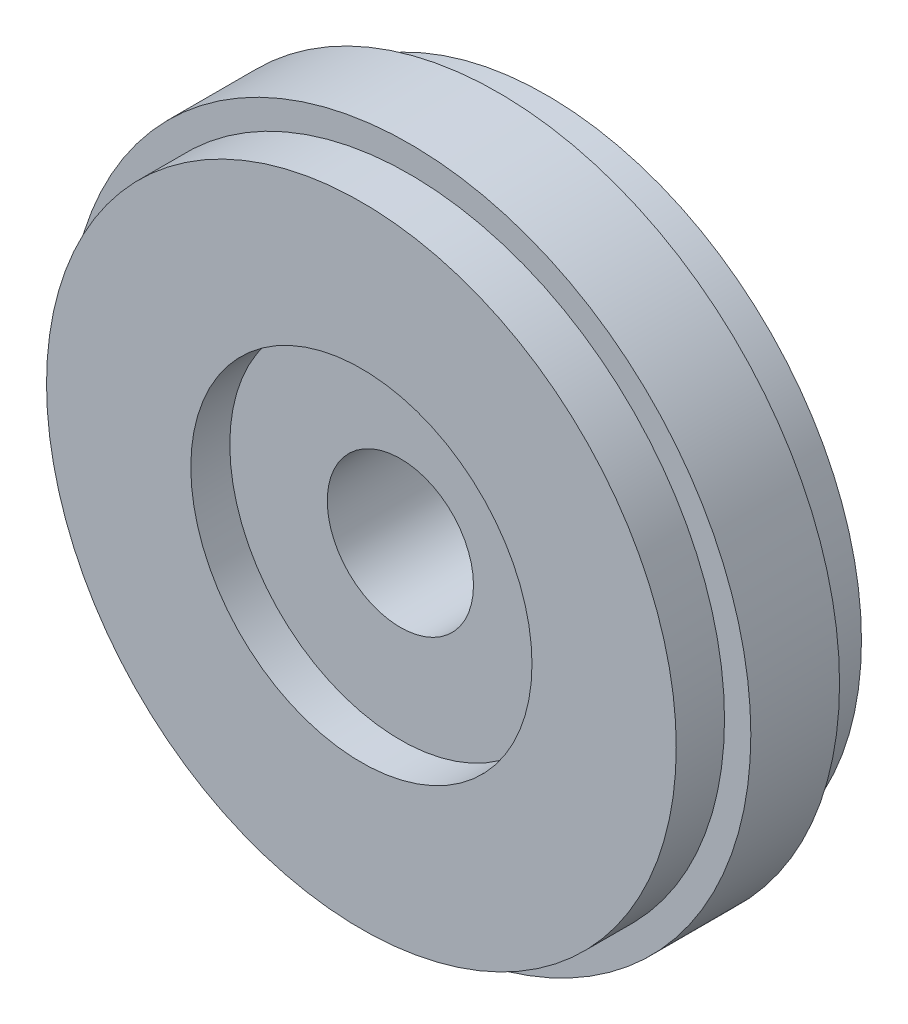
ISO-10303-21;
HEADER;
FILE_DESCRIPTION(('STEP AP214'),'2;1');
FILE_NAME('part.step','',(''),(''),'','','');
FILE_SCHEMA(('AUTOMOTIVE_DESIGN { 1 0 10303 214 1 1 1 1 }'));
ENDSEC;
DATA;
#1=APPLICATION_CONTEXT('core data for automotive mechanical design processes');
#2=APPLICATION_PROTOCOL_DEFINITION('international standard','automotive_design',2000,#1);
#3=PRODUCT_CONTEXT('',#1,'mechanical');
#4=PRODUCT('Part','Part','',(#3));
#5=PRODUCT_RELATED_PRODUCT_CATEGORY('part','',(#4));
#6=PRODUCT_DEFINITION_FORMATION('','',#4);
#7=PRODUCT_DEFINITION_CONTEXT('part definition',#1,'design');
#8=PRODUCT_DEFINITION('design','',#6,#7);
#9=PRODUCT_DEFINITION_SHAPE('','',#8);
#10=(LENGTH_UNIT() NAMED_UNIT(*) SI_UNIT(.MILLI.,.METRE.));
#11=(NAMED_UNIT(*) PLANE_ANGLE_UNIT() SI_UNIT($,.RADIAN.));
#12=(NAMED_UNIT(*) SI_UNIT($,.STERADIAN.) SOLID_ANGLE_UNIT());
#13=UNCERTAINTY_MEASURE_WITH_UNIT(LENGTH_MEASURE(1.E-05),#10,'distance_accuracy_value','');
#14=(GEOMETRIC_REPRESENTATION_CONTEXT(3) GLOBAL_UNCERTAINTY_ASSIGNED_CONTEXT((#13)) GLOBAL_UNIT_ASSIGNED_CONTEXT((#10,
#11,#12)) REPRESENTATION_CONTEXT('',''));
#15=CARTESIAN_POINT('',(0.,0.,0.));
#16=DIRECTION('',(0.,0.,1.));
#17=DIRECTION('',(1.,0.,0.));
#18=AXIS2_PLACEMENT_3D('',#15,#16,#17);
#19=CARTESIAN_POINT('',(0.,35.,9.5));
#20=DIRECTION('',(0.,0.,-1.));
#21=DIRECTION('',(-1.,0.,0.));
#22=AXIS2_PLACEMENT_3D('',#19,#20,#21);
#23=PLANE('',#22);
#24=CARTESIAN_POINT('',(0.,0.,9.5));
#25=DIRECTION('',(0.,0.,1.));
#26=DIRECTION('',(1.,0.,0.));
#27=AXIS2_PLACEMENT_3D('',#24,#25,#26);
#28=CIRCLE('',#27,17.5);
#29=CARTESIAN_POINT('',(17.5,0.,9.5));
#30=VERTEX_POINT('',#29);
#31=EDGE_CURVE('E8',#30,#30,#28,.T.);
#32=ORIENTED_EDGE('',*,*,#31,.F.);
#33=EDGE_LOOP('',(#32));
#34=FACE_BOUND('',#33,.T.);
#35=CARTESIAN_POINT('',(0.,0.,9.5));
#36=DIRECTION('',(0.,0.,-1.));
#37=DIRECTION('',(-1.,0.,0.));
#38=AXIS2_PLACEMENT_3D('',#35,#36,#37);
#39=CIRCLE('',#38,32.3);
#40=CARTESIAN_POINT('',(-32.3,0.,9.5));
#41=VERTEX_POINT('',#40);
#42=EDGE_CURVE('E15',#41,#41,#39,.T.);
#43=ORIENTED_EDGE('',*,*,#42,.F.);
#44=EDGE_LOOP('',(#43));
#45=FACE_BOUND('',#44,.T.);
#46=ADVANCED_FACE('F12',(#34,#45),#23,.F.);
#47=CARTESIAN_POINT('',(0.,14.5,-9.5));
#48=DIRECTION('',(0.,0.,1.));
#49=DIRECTION('',(1.,0.,0.));
#50=AXIS2_PLACEMENT_3D('',#47,#48,#49);
#51=PLANE('',#50);
#52=CARTESIAN_POINT('',(0.,0.,-9.5));
#53=DIRECTION('',(0.,0.,1.));
#54=DIRECTION('',(1.,0.,0.));
#55=AXIS2_PLACEMENT_3D('',#52,#53,#54);
#56=CIRCLE('',#55,14.5);
#57=CARTESIAN_POINT('',(14.5,0.,-9.5));
#58=VERTEX_POINT('',#57);
#59=EDGE_CURVE('E33',#58,#58,#56,.T.);
#60=ORIENTED_EDGE('',*,*,#59,.T.);
#61=EDGE_LOOP('',(#60));
#62=FACE_BOUND('',#61,.T.);
#63=CARTESIAN_POINT('',(0.,0.,-9.5));
#64=DIRECTION('',(0.,0.,1.));
#65=DIRECTION('',(1.,0.,0.));
#66=AXIS2_PLACEMENT_3D('',#63,#64,#65);
#67=CIRCLE('',#66,32.3);
#68=CARTESIAN_POINT('',(32.3,0.,-9.5));
#69=VERTEX_POINT('',#68);
#70=EDGE_CURVE('E27',#69,#69,#67,.T.);
#71=ORIENTED_EDGE('',*,*,#70,.F.);
#72=EDGE_LOOP('',(#71));
#73=FACE_BOUND('',#72,.T.);
#74=ADVANCED_FACE('F64',(#62,#73),#51,.F.);
#75=CARTESIAN_POINT('',(0.,0.,4.9819902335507));
#76=DIRECTION('',(0.,0.,1.));
#77=DIRECTION('',(1.,0.,0.));
#78=AXIS2_PLACEMENT_3D('',#75,#76,#77);
#79=CYLINDRICAL_SURFACE('',#78,17.5);
#80=CARTESIAN_POINT('',(0.,0.,5.5));
#81=DIRECTION('',(0.,0.,1.));
#82=DIRECTION('',(1.,0.,0.));
#83=AXIS2_PLACEMENT_3D('',#80,#81,#82);
#84=CIRCLE('',#83,17.5);
#85=CARTESIAN_POINT('',(17.5,0.,5.5));
#86=VERTEX_POINT('',#85);
#87=EDGE_CURVE('E19',#86,#86,#84,.T.);
#88=ORIENTED_EDGE('',*,*,#87,.F.);
#89=EDGE_LOOP('',(#88));
#90=FACE_BOUND('',#89,.T.);
#91=ORIENTED_EDGE('',*,*,#31,.T.);
#92=EDGE_LOOP('',(#91));
#93=FACE_BOUND('',#92,.T.);
#94=ADVANCED_FACE('F59',(#90,#93),#79,.F.);
#95=CARTESIAN_POINT('',(0.,17.5,5.5));
#96=DIRECTION('',(0.,0.,-1.));
#97=DIRECTION('',(-1.,0.,0.));
#98=AXIS2_PLACEMENT_3D('',#95,#96,#97);
#99=PLANE('',#98);
#100=CARTESIAN_POINT('',(0.,0.,5.5));
#101=DIRECTION('',(0.,0.,1.));
#102=DIRECTION('',(1.,0.,0.));
#103=AXIS2_PLACEMENT_3D('',#100,#101,#102);
#104=CIRCLE('',#103,7.5);
#105=CARTESIAN_POINT('',(7.5,0.,5.5));
#106=VERTEX_POINT('',#105);
#107=EDGE_CURVE('E24',#106,#106,#104,.T.);
#108=ORIENTED_EDGE('',*,*,#107,.F.);
#109=EDGE_LOOP('',(#108));
#110=FACE_BOUND('',#109,.T.);
#111=ORIENTED_EDGE('',*,*,#87,.T.);
#112=EDGE_LOOP('',(#111));
#113=FACE_BOUND('',#112,.T.);
#114=ADVANCED_FACE('F56',(#110,#113),#99,.F.);
#115=CARTESIAN_POINT('',(0.,0.,4.9819902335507));
#116=DIRECTION('',(0.,0.,1.));
#117=DIRECTION('',(1.,0.,0.));
#118=AXIS2_PLACEMENT_3D('',#115,#116,#117);
#119=CYLINDRICAL_SURFACE('',#118,7.5);
#120=CARTESIAN_POINT('',(0.,0.,-5.5));
#121=DIRECTION('',(0.,0.,1.));
#122=DIRECTION('',(1.,0.,0.));
#123=AXIS2_PLACEMENT_3D('',#120,#121,#122);
#124=CIRCLE('',#123,7.5);
#125=CARTESIAN_POINT('',(7.5,0.,-5.5));
#126=VERTEX_POINT('',#125);
#127=EDGE_CURVE('E49',#126,#126,#124,.T.);
#128=ORIENTED_EDGE('',*,*,#127,.F.);
#129=EDGE_LOOP('',(#128));
#130=FACE_BOUND('',#129,.T.);
#131=ORIENTED_EDGE('',*,*,#107,.T.);
#132=EDGE_LOOP('',(#131));
#133=FACE_BOUND('',#132,.T.);
#134=ADVANCED_FACE('F54',(#130,#133),#119,.F.);
#135=CARTESIAN_POINT('',(0.,7.5,-5.5));
#136=DIRECTION('',(0.,0.,1.));
#137=DIRECTION('',(1.,0.,0.));
#138=AXIS2_PLACEMENT_3D('',#135,#136,#137);
#139=PLANE('',#138);
#140=CARTESIAN_POINT('',(0.,0.,-5.5));
#141=DIRECTION('',(0.,0.,1.));
#142=DIRECTION('',(1.,0.,0.));
#143=AXIS2_PLACEMENT_3D('',#140,#141,#142);
#144=CIRCLE('',#143,14.5);
#145=CARTESIAN_POINT('',(14.5,0.,-5.5));
#146=VERTEX_POINT('',#145);
#147=EDGE_CURVE('E46',#146,#146,#144,.T.);
#148=ORIENTED_EDGE('',*,*,#147,.F.);
#149=EDGE_LOOP('',(#148));
#150=FACE_BOUND('',#149,.T.);
#151=ORIENTED_EDGE('',*,*,#127,.T.);
#152=EDGE_LOOP('',(#151));
#153=FACE_BOUND('',#152,.T.);
#154=ADVANCED_FACE('F94',(#150,#153),#139,.F.);
#155=CARTESIAN_POINT('',(0.,0.,4.9819902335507));
#156=DIRECTION('',(0.,0.,1.));
#157=DIRECTION('',(1.,0.,0.));
#158=AXIS2_PLACEMENT_3D('',#155,#156,#157);
#159=CYLINDRICAL_SURFACE('',#158,14.5);
#160=ORIENTED_EDGE('',*,*,#59,.F.);
#161=EDGE_LOOP('',(#160));
#162=FACE_BOUND('',#161,.T.);
#163=ORIENTED_EDGE('',*,*,#147,.T.);
#164=EDGE_LOOP('',(#163));
#165=FACE_BOUND('',#164,.T.);
#166=ADVANCED_FACE('F83',(#162,#165),#159,.F.);
#167=CARTESIAN_POINT('',(0.,0.,19.1261042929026));
#168=DIRECTION('',(0.,0.,1.));
#169=DIRECTION('',(1.,0.,0.));
#170=AXIS2_PLACEMENT_3D('',#167,#168,#169);
#171=CYLINDRICAL_SURFACE('',#170,32.3);
#172=CARTESIAN_POINT('',(0.,0.,4.55));
#173=DIRECTION('',(0.,0.,1.));
#174=DIRECTION('',(1.,0.,0.));
#175=AXIS2_PLACEMENT_3D('',#172,#173,#174);
#176=CIRCLE('',#175,32.3);
#177=CARTESIAN_POINT('',(32.3,0.,4.55));
#178=VERTEX_POINT('',#177);
#179=EDGE_CURVE('E40',#178,#178,#176,.T.);
#180=ORIENTED_EDGE('',*,*,#179,.T.);
#181=EDGE_LOOP('',(#180));
#182=FACE_BOUND('',#181,.T.);
#183=ORIENTED_EDGE('',*,*,#42,.T.);
#184=EDGE_LOOP('',(#183));
#185=FACE_BOUND('',#184,.T.);
#186=ADVANCED_FACE('F80',(#182,#185),#171,.T.);
#187=CARTESIAN_POINT('',(0.,0.,19.1261042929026));
#188=DIRECTION('',(0.,0.,1.));
#189=DIRECTION('',(1.,0.,0.));
#190=AXIS2_PLACEMENT_3D('',#187,#188,#189);
#191=CYLINDRICAL_SURFACE('',#190,32.3);
#192=CARTESIAN_POINT('',(0.,0.,-4.55));
#193=DIRECTION('',(0.,0.,1.));
#194=DIRECTION('',(1.,0.,0.));
#195=AXIS2_PLACEMENT_3D('',#192,#193,#194);
#196=CIRCLE('',#195,32.3);
#197=CARTESIAN_POINT('',(32.3,0.,-4.55));
#198=VERTEX_POINT('',#197);
#199=EDGE_CURVE('E35',#198,#198,#196,.T.);
#200=ORIENTED_EDGE('',*,*,#199,.F.);
#201=EDGE_LOOP('',(#200));
#202=FACE_BOUND('',#201,.T.);
#203=ORIENTED_EDGE('',*,*,#70,.T.);
#204=EDGE_LOOP('',(#203));
#205=FACE_BOUND('',#204,.T.);
#206=ADVANCED_FACE('F82',(#202,#205),#191,.T.);
#207=CARTESIAN_POINT('',(0.,0.,19.1261042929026));
#208=DIRECTION('',(0.,0.,1.));
#209=DIRECTION('',(1.,0.,0.));
#210=AXIS2_PLACEMENT_3D('',#207,#208,#209);
#211=CYLINDRICAL_SURFACE('',#210,35.);
#212=CARTESIAN_POINT('',(0.,0.,-4.55));
#213=DIRECTION('',(0.,0.,1.));
#214=DIRECTION('',(1.,0.,0.));
#215=AXIS2_PLACEMENT_3D('',#212,#213,#214);
#216=CIRCLE('',#215,35.);
#217=CARTESIAN_POINT('',(35.,0.,-4.55));
#218=VERTEX_POINT('',#217);
#219=EDGE_CURVE('E29',#218,#218,#216,.T.);
#220=ORIENTED_EDGE('',*,*,#219,.T.);
#221=EDGE_LOOP('',(#220));
#222=FACE_BOUND('',#221,.T.);
#223=CARTESIAN_POINT('',(0.,0.,4.55));
#224=DIRECTION('',(0.,0.,1.));
#225=DIRECTION('',(1.,0.,0.));
#226=AXIS2_PLACEMENT_3D('',#223,#224,#225);
#227=CIRCLE('',#226,35.);
#228=CARTESIAN_POINT('',(35.,0.,4.55));
#229=VERTEX_POINT('',#228);
#230=EDGE_CURVE('E189',#229,#229,#227,.T.);
#231=ORIENTED_EDGE('',*,*,#230,.F.);
#232=EDGE_LOOP('',(#231));
#233=FACE_BOUND('',#232,.T.);
#234=ADVANCED_FACE('F91',(#222,#233),#211,.T.);
#235=CARTESIAN_POINT('',(0.,32.3,-4.55));
#236=DIRECTION('',(0.,0.,-1.));
#237=DIRECTION('',(-1.,0.,0.));
#238=AXIS2_PLACEMENT_3D('',#235,#236,#237);
#239=PLANE('',#238);
#240=ORIENTED_EDGE('',*,*,#199,.T.);
#241=EDGE_LOOP('',(#240));
#242=FACE_BOUND('',#241,.T.);
#243=ORIENTED_EDGE('',*,*,#219,.F.);
#244=EDGE_LOOP('',(#243));
#245=FACE_BOUND('',#244,.T.);
#246=ADVANCED_FACE('F101',(#242,#245),#239,.T.);
#247=CARTESIAN_POINT('',(0.,35.,4.55));
#248=DIRECTION('',(0.,0.,1.));
#249=DIRECTION('',(1.,0.,0.));
#250=AXIS2_PLACEMENT_3D('',#247,#248,#249);
#251=PLANE('',#250);
#252=ORIENTED_EDGE('',*,*,#230,.T.);
#253=EDGE_LOOP('',(#252));
#254=FACE_BOUND('',#253,.T.);
#255=ORIENTED_EDGE('',*,*,#179,.F.);
#256=EDGE_LOOP('',(#255));
#257=FACE_BOUND('',#256,.T.);
#258=ADVANCED_FACE('F99',(#254,#257),#251,.T.);
#259=CLOSED_SHELL('',(#46,#74,#94,#114,#134,#154,#166,#186,#206,#234,#246,#258));
#260=MANIFOLD_SOLID_BREP('B1',#259);
#261=ADVANCED_BREP_SHAPE_REPRESENTATION('',(#18,#260),#14);
#262=SHAPE_DEFINITION_REPRESENTATION(#9,#261);
ENDSEC;
END-ISO-10303-21;
